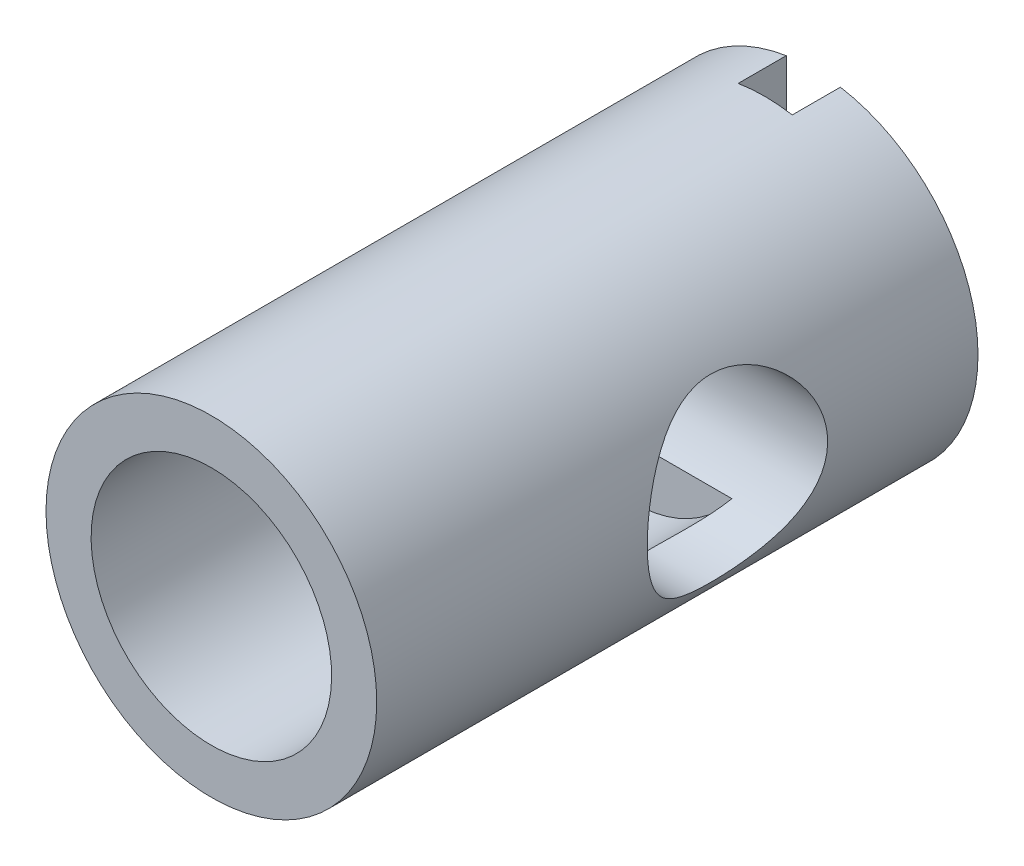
ISO-10303-21;
HEADER;
FILE_DESCRIPTION(('STEP AP214'),'2;1');
FILE_NAME('part.step','',(''),(''),'','','');
FILE_SCHEMA(('AUTOMOTIVE_DESIGN { 1 0 10303 214 1 1 1 1 }'));
ENDSEC;
DATA;
#1=APPLICATION_CONTEXT('core data for automotive mechanical design processes');
#2=APPLICATION_PROTOCOL_DEFINITION('international standard','automotive_design',2000,#1);
#3=PRODUCT_CONTEXT('',#1,'mechanical');
#4=PRODUCT('Part','Part','',(#3));
#5=PRODUCT_RELATED_PRODUCT_CATEGORY('part','',(#4));
#6=PRODUCT_DEFINITION_FORMATION('','',#4);
#7=PRODUCT_DEFINITION_CONTEXT('part definition',#1,'design');
#8=PRODUCT_DEFINITION('design','',#6,#7);
#9=PRODUCT_DEFINITION_SHAPE('','',#8);
#10=(LENGTH_UNIT() NAMED_UNIT(*) SI_UNIT(.MILLI.,.METRE.));
#11=(NAMED_UNIT(*) PLANE_ANGLE_UNIT() SI_UNIT($,.RADIAN.));
#12=(NAMED_UNIT(*) SI_UNIT($,.STERADIAN.) SOLID_ANGLE_UNIT());
#13=UNCERTAINTY_MEASURE_WITH_UNIT(LENGTH_MEASURE(1.E-05),#10,'distance_accuracy_value','');
#14=(GEOMETRIC_REPRESENTATION_CONTEXT(3) GLOBAL_UNCERTAINTY_ASSIGNED_CONTEXT((#13)) GLOBAL_UNIT_ASSIGNED_CONTEXT((#10,
#11,#12)) REPRESENTATION_CONTEXT('',''));
#15=CARTESIAN_POINT('',(0.,0.,0.));
#16=DIRECTION('',(0.,0.,1.));
#17=DIRECTION('',(1.,0.,0.));
#18=AXIS2_PLACEMENT_3D('',#15,#16,#17);
#19=CARTESIAN_POINT('',(0.461597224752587,0.,0.8));
#20=DIRECTION('',(0.,0.,1.));
#21=DIRECTION('',(1.,0.,0.));
#22=AXIS2_PLACEMENT_3D('',#19,#20,#21);
#23=PLANE('',#22);
#24=DIRECTION('',(0.,1.,0.));
#25=VECTOR('',#24,1.);
#26=CARTESIAN_POINT('',(-0.438402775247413,0.,0.8));
#27=LINE('',#26,#25);
#28=CARTESIAN_POINT('',(-0.438402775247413,-2.71483019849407,0.8));
#29=VERTEX_POINT('',#28);
#30=CARTESIAN_POINT('',(-0.438402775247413,2.71483019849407,0.8));
#31=VERTEX_POINT('',#30);
#32=EDGE_CURVE('E83',#29,#31,#27,.T.);
#33=ORIENTED_EDGE('',*,*,#32,.T.);
#34=CARTESIAN_POINT('',(0.,0.,0.8));
#35=DIRECTION('',(0.,0.,1.));
#36=DIRECTION('',(1.,0.,0.));
#37=AXIS2_PLACEMENT_3D('',#34,#35,#36);
#38=CIRCLE('',#37,2.75);
#39=CARTESIAN_POINT('',(0.461597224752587,2.71098284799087,0.8));
#40=VERTEX_POINT('',#39);
#41=EDGE_CURVE('E21',#40,#31,#38,.T.);
#42=ORIENTED_EDGE('',*,*,#41,.F.);
#43=DIRECTION('',(0.,1.,0.));
#44=VECTOR('',#43,1.);
#45=CARTESIAN_POINT('',(0.461597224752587,0.,0.8));
#46=LINE('',#45,#44);
#47=CARTESIAN_POINT('',(0.461597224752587,-2.71098284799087,0.8));
#48=VERTEX_POINT('',#47);
#49=EDGE_CURVE('E76',#40,#48,#46,.F.);
#50=ORIENTED_EDGE('',*,*,#49,.T.);
#51=CARTESIAN_POINT('',(0.,0.,0.8));
#52=DIRECTION('',(0.,0.,1.));
#53=DIRECTION('',(1.,0.,0.));
#54=AXIS2_PLACEMENT_3D('',#51,#52,#53);
#55=CIRCLE('',#54,2.75);
#56=EDGE_CURVE('E84',#29,#48,#55,.T.);
#57=ORIENTED_EDGE('',*,*,#56,.F.);
#58=EDGE_LOOP('',(#33,#42,#50,#57));
#59=FACE_BOUND('',#58,.T.);
#60=ADVANCED_FACE('F16',(#59),#23,.F.);
#61=CARTESIAN_POINT('',(-1.6583123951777,2.0088196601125,3.));
#62=DIRECTION('',(0.,0.,-1.));
#63=DIRECTION('',(1.,0.,0.));
#64=AXIS2_PLACEMENT_3D('',#61,#62,#63);
#65=PLANE('',#64);
#66=CARTESIAN_POINT('',(0.,0.,3.));
#67=DIRECTION('',(0.,0.,-1.));
#68=DIRECTION('',(0.,1.,0.));
#69=AXIS2_PLACEMENT_3D('',#66,#67,#68);
#70=CIRCLE('',#69,2.);
#71=CARTESIAN_POINT('',(1.65831239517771,1.1180339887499,3.));
#72=VERTEX_POINT('',#71);
#73=CARTESIAN_POINT('',(-1.6583123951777,1.1180339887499,3.));
#74=VERTEX_POINT('',#73);
#75=EDGE_CURVE('E152',#72,#74,#70,.F.);
#76=ORIENTED_EDGE('',*,*,#75,.T.);
#77=DIRECTION('',(1.,0.,0.));
#78=VECTOR('',#77,1.);
#79=CARTESIAN_POINT('',(0.,1.11803398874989,3.));
#80=LINE('',#79,#78);
#81=EDGE_CURVE('E136',#74,#72,#80,.T.);
#82=ORIENTED_EDGE('',*,*,#81,.T.);
#83=EDGE_LOOP('',(#76,#82));
#84=FACE_BOUND('',#83,.T.);
#85=ADVANCED_FACE('F155',(#84),#65,.F.);
#86=CARTESIAN_POINT('',(-1.6583123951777,-1.11803398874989,3.));
#87=DIRECTION('',(0.,0.,-1.));
#88=DIRECTION('',(1.,0.,0.));
#89=AXIS2_PLACEMENT_3D('',#86,#87,#88);
#90=PLANE('',#89);
#91=CARTESIAN_POINT('',(0.,0.,3.));
#92=DIRECTION('',(0.,0.,-1.));
#93=DIRECTION('',(0.,1.,0.));
#94=AXIS2_PLACEMENT_3D('',#91,#92,#93);
#95=CIRCLE('',#94,2.);
#96=CARTESIAN_POINT('',(-1.65831239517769,-1.11803398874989,3.));
#97=VERTEX_POINT('',#96);
#98=CARTESIAN_POINT('',(1.6583123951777,-1.11803398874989,3.));
#99=VERTEX_POINT('',#98);
#100=EDGE_CURVE('E77',#97,#99,#95,.F.);
#101=ORIENTED_EDGE('',*,*,#100,.T.);
#102=DIRECTION('',(1.,0.,0.));
#103=VECTOR('',#102,1.);
#104=CARTESIAN_POINT('',(0.,-1.11803398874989,3.));
#105=LINE('',#104,#103);
#106=EDGE_CURVE('E131',#99,#97,#105,.F.);
#107=ORIENTED_EDGE('',*,*,#106,.T.);
#108=EDGE_LOOP('',(#101,#107));
#109=FACE_BOUND('',#108,.T.);
#110=ADVANCED_FACE('F166',(#109),#90,.F.);
#111=CARTESIAN_POINT('',(0.,0.,10.));
#112=DIRECTION('',(0.,0.,-1.));
#113=DIRECTION('',(0.,1.,0.));
#114=AXIS2_PLACEMENT_3D('',#111,#112,#113);
#115=CYLINDRICAL_SURFACE('',#114,2.);
#116=ORIENTED_EDGE('',*,*,#100,.F.);
#117=CARTESIAN_POINT('',(-1.65831239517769,-1.11803398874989,3.));
#118=CARTESIAN_POINT('',(-1.6400012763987,-1.14520243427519,3.03038665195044));
#119=CARTESIAN_POINT('',(-1.62156036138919,-1.17110586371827,3.06182893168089));
#120=CARTESIAN_POINT('',(-1.58483591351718,-1.2203420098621,3.12682430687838));
#121=CARTESIAN_POINT('',(-1.56655260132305,-1.24367153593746,3.16037994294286));
#122=CARTESIAN_POINT('',(-1.53036731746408,-1.28794596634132,3.22998871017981));
#123=CARTESIAN_POINT('',(-1.51247370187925,-1.30885485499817,3.26606921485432));
#124=CARTESIAN_POINT('',(-1.47789034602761,-1.34778265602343,3.34027475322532));
#125=CARTESIAN_POINT('',(-1.46119995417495,-1.36580313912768,3.37839866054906));
#126=CARTESIAN_POINT('',(-1.4221746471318,-1.40660834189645,3.47524275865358));
#127=CARTESIAN_POINT('',(-1.40090414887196,-1.42761465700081,3.53517533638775));
#128=CARTESIAN_POINT('',(-1.36490098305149,-1.4620776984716,3.65879844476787));
#129=CARTESIAN_POINT('',(-1.35013694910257,-1.47557072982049,3.72246923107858));
#130=CARTESIAN_POINT('',(-1.32939675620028,-1.49429450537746,3.85338363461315));
#131=CARTESIAN_POINT('',(-1.32353695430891,-1.49941591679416,3.92066285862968));
#132=CARTESIAN_POINT('',(-1.3223225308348,-1.50048867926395,4.05541196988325));
#133=CARTESIAN_POINT('',(-1.3269691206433,-1.49643897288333,4.12288187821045));
#134=CARTESIAN_POINT('',(-1.34420038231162,-1.48095304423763,4.2448675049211));
#135=CARTESIAN_POINT('',(-1.3554261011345,-1.47077461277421,4.29975559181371));
#136=CARTESIAN_POINT('',(-1.38305583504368,-1.44482424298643,4.40684423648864));
#137=CARTESIAN_POINT('',(-1.39946552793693,-1.4290461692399,4.45904177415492));
#138=CARTESIAN_POINT('',(-1.44662419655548,-1.38164647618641,4.59025697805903));
#139=CARTESIAN_POINT('',(-1.48011596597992,-1.34617237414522,4.66689284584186));
#140=CARTESIAN_POINT('',(-1.55090672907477,-1.26398116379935,4.81199139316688));
#141=CARTESIAN_POINT('',(-1.5882144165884,-1.21723803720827,4.88043460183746));
#142=CARTESIAN_POINT('',(-1.66386796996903,-1.11170243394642,5.01060779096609));
#143=CARTESIAN_POINT('',(-1.70221331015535,-1.05260616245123,5.07209270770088));
#144=CARTESIAN_POINT('',(-1.77546249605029,-0.923696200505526,5.18494717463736));
#145=CARTESIAN_POINT('',(-1.81037197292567,-0.853900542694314,5.23633341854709));
#146=CARTESIAN_POINT('',(-1.86813358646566,-0.717339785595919,5.31933444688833));
#147=CARTESIAN_POINT('',(-1.89202675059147,-0.652166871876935,5.35283425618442));
#148=CARTESIAN_POINT('',(-1.93362191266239,-0.515913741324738,5.41042246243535));
#149=CARTESIAN_POINT('',(-1.95132750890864,-0.444836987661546,5.43451633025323));
#150=CARTESIAN_POINT('',(-1.97910694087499,-0.297918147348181,5.47208219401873));
#151=CARTESIAN_POINT('',(-1.98912872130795,-0.222047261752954,5.48548176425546));
#152=CARTESIAN_POINT('',(-2.00030454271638,-0.0685078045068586,5.50041471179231));
#153=CARTESIAN_POINT('',(-2.00146359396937,0.00915972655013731,5.50195479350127));
#154=CARTESIAN_POINT('',(-1.99518445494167,0.154775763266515,5.49357461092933));
#155=CARTESIAN_POINT('',(-1.98868900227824,0.222843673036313,5.48491110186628));
#156=CARTESIAN_POINT('',(-1.96916967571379,0.356254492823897,5.45866585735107));
#157=CARTESIAN_POINT('',(-1.95614465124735,0.421596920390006,5.441082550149));
#158=CARTESIAN_POINT('',(-1.92418864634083,0.54949306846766,5.39740060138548));
#159=CARTESIAN_POINT('',(-1.90513410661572,0.611953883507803,5.37112323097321));
#160=CARTESIAN_POINT('',(-1.86249552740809,0.731536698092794,5.31123264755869));
#161=CARTESIAN_POINT('',(-1.83891076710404,0.78865784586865,5.2776182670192));
#162=CARTESIAN_POINT('',(-1.78450202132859,0.90573606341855,5.19809181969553));
#163=CARTESIAN_POINT('',(-1.75312361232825,0.964680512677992,5.15107224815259));
#164=CARTESIAN_POINT('',(-1.68813652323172,1.07437042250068,5.0494439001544));
#165=CARTESIAN_POINT('',(-1.65452360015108,1.12509961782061,4.99482045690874));
#166=CARTESIAN_POINT('',(-1.58084031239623,1.22703553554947,4.86734904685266));
#167=CARTESIAN_POINT('',(-1.54078553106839,1.276416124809,4.7930228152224));
#168=CARTESIAN_POINT('',(-1.46567311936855,1.36199370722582,4.63484051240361));
#169=CARTESIAN_POINT('',(-1.4306046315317,1.39821962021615,4.55100588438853));
#170=CARTESIAN_POINT('',(-1.38314185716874,1.44485003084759,4.40719545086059));
#171=CARTESIAN_POINT('',(-1.36716246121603,1.45984805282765,4.34990890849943));
#172=CARTESIAN_POINT('',(-1.3419534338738,1.4830571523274,4.23259346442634));
#173=CARTESIAN_POINT('',(-1.33270803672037,1.49128408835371,4.17257132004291));
#174=CARTESIAN_POINT('',(-1.32245654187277,1.5003878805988,4.05080930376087));
#175=CARTESIAN_POINT('',(-1.32150793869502,1.50121344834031,3.98906041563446));
#176=CARTESIAN_POINT('',(-1.32818926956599,1.49530197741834,3.86638746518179));
#177=CARTESIAN_POINT('',(-1.3358256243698,1.4885592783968,3.80546405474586));
#178=CARTESIAN_POINT('',(-1.36008668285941,1.46644668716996,3.67681696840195));
#179=CARTESIAN_POINT('',(-1.37794170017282,1.44988124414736,3.60954123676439));
#180=CARTESIAN_POINT('',(-1.42022023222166,1.40849062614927,3.47957430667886));
#181=CARTESIAN_POINT('',(-1.44467270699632,1.38362891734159,3.41690490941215));
#182=CARTESIAN_POINT('',(-1.49984097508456,1.32374125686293,3.29073686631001));
#183=CARTESIAN_POINT('',(-1.53093704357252,1.28795321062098,3.2277692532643));
#184=CARTESIAN_POINT('',(-1.57851347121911,1.22838778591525,3.13841679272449));
#185=CARTESIAN_POINT('',(-1.59443943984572,1.20767912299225,3.10962408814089));
#186=CARTESIAN_POINT('',(-1.62637642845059,1.16431268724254,3.05362474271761));
#187=CARTESIAN_POINT('',(-1.64238739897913,1.14165595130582,3.02641727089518));
#188=CARTESIAN_POINT('',(-1.6583123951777,1.11803398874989,3.));
#189=B_SPLINE_CURVE_WITH_KNOTS('',3,(#117,#118,#119,#120,#121,#122,#123,#124,#125,#126,#127,
#128,#129,#130,#131,#132,#133,#134,#135,#136,#137,#138,#139,#140,#141,#142,#143,#144,#145,#146,
#147,#148,#149,#150,#151,#152,#153,#154,#155,#156,#157,#158,#159,#160,#161,#162,#163,#164,#165,
#166,#167,#168,#169,#170,#171,#172,#173,#174,#175,#176,#177,#178,#179,#180,#181,#182,#183,#184,
#185,#186,#187,#188),.UNSPECIFIED.,.F.,.F.,(4,2,2,2,2,2,2,2,2,2,2,2,2,2,2,2,2,2,2,2,2,2,2,2,2,2,
2,2,2,2,2,2,2,2,2,4),(0.,0.134027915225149,0.268220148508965,0.404204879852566,
0.540115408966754,0.740313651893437,0.93953592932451,1.14133983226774,1.34316700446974,
1.51334725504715,1.68371454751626,1.9547732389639,2.22646385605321,2.50585008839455,
2.78477052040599,3.01507530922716,3.24524594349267,3.47696245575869,3.70854796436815,
3.91435182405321,4.12019196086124,4.33055797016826,4.54095747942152,4.78507626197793,
5.0296726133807,5.32184186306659,5.61336484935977,5.79671909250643,5.97964267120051,
6.16383286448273,6.34816090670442,6.56163488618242,6.77606161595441,7.01169631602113,
7.12826468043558,7.24477137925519),.UNSPECIFIED.);
#190=EDGE_CURVE('E125',#97,#74,#189,.T.);
#191=ORIENTED_EDGE('',*,*,#190,.T.);
#192=ORIENTED_EDGE('',*,*,#75,.F.);
#193=CARTESIAN_POINT('',(1.65831239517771,1.1180339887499,3.));
#194=CARTESIAN_POINT('',(1.64000127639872,1.14520243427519,3.03038665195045));
#195=CARTESIAN_POINT('',(1.62156036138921,1.17110586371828,3.0618289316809));
#196=CARTESIAN_POINT('',(1.5848359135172,1.22034200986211,3.12682430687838));
#197=CARTESIAN_POINT('',(1.56655260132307,1.24367153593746,3.16037994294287));
#198=CARTESIAN_POINT('',(1.5303673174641,1.28794596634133,3.22998871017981));
#199=CARTESIAN_POINT('',(1.51247370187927,1.30885485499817,3.26606921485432));
#200=CARTESIAN_POINT('',(1.47789034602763,1.34778265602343,3.34027475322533));
#201=CARTESIAN_POINT('',(1.46119995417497,1.36580313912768,3.37839866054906));
#202=CARTESIAN_POINT('',(1.42217464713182,1.40660834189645,3.47524275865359));
#203=CARTESIAN_POINT('',(1.40090414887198,1.42761465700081,3.53517533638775));
#204=CARTESIAN_POINT('',(1.36490098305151,1.46207769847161,3.65879844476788));
#205=CARTESIAN_POINT('',(1.35013694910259,1.47557072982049,3.72246923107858));
#206=CARTESIAN_POINT('',(1.32939675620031,1.49429450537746,3.85338363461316));
#207=CARTESIAN_POINT('',(1.32353695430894,1.49941591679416,3.92066285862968));
#208=CARTESIAN_POINT('',(1.32232253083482,1.50048867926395,4.05541196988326));
#209=CARTESIAN_POINT('',(1.32696912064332,1.49643897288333,4.12288187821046));
#210=CARTESIAN_POINT('',(1.34420038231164,1.48095304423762,4.24486750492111));
#211=CARTESIAN_POINT('',(1.35542610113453,1.47077461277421,4.29975559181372));
#212=CARTESIAN_POINT('',(1.38305583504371,1.44482424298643,4.40684423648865));
#213=CARTESIAN_POINT('',(1.39946552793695,1.4290461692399,4.45904177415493));
#214=CARTESIAN_POINT('',(1.4466241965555,1.3816464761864,4.59025697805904));
#215=CARTESIAN_POINT('',(1.48011596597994,1.34617237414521,4.66689284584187));
#216=CARTESIAN_POINT('',(1.5509067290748,1.26398116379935,4.81199139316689));
#217=CARTESIAN_POINT('',(1.58821441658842,1.21723803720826,4.88043460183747));
#218=CARTESIAN_POINT('',(1.66386796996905,1.11170243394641,5.0106077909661));
#219=CARTESIAN_POINT('',(1.70221331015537,1.05260616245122,5.07209270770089));
#220=CARTESIAN_POINT('',(1.77546249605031,0.923696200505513,5.18494717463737));
#221=CARTESIAN_POINT('',(1.81037197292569,0.8539005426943,5.2363334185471));
#222=CARTESIAN_POINT('',(1.86813358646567,0.717339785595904,5.31933444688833));
#223=CARTESIAN_POINT('',(1.89202675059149,0.65216687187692,5.35283425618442));
#224=CARTESIAN_POINT('',(1.9336219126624,0.515913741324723,5.41042246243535));
#225=CARTESIAN_POINT('',(1.95132750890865,0.444836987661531,5.43451633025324));
#226=CARTESIAN_POINT('',(1.979106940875,0.297918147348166,5.47208219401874));
#227=CARTESIAN_POINT('',(1.98912872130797,0.222047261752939,5.48548176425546));
#228=CARTESIAN_POINT('',(2.00030454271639,0.0685078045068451,5.50041471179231));
#229=CARTESIAN_POINT('',(2.00146359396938,-0.00915972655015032,5.50195479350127));
#230=CARTESIAN_POINT('',(1.99518445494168,-0.154775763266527,5.49357461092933));
#231=CARTESIAN_POINT('',(1.98868900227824,-0.222843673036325,5.48491110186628));
#232=CARTESIAN_POINT('',(1.96916967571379,-0.356254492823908,5.45866585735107));
#233=CARTESIAN_POINT('',(1.95614465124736,-0.421596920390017,5.441082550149));
#234=CARTESIAN_POINT('',(1.92418864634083,-0.549493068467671,5.39740060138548));
#235=CARTESIAN_POINT('',(1.90513410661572,-0.611953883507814,5.37112323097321));
#236=CARTESIAN_POINT('',(1.86249552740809,-0.731536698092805,5.31123264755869));
#237=CARTESIAN_POINT('',(1.83891076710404,-0.78865784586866,5.2776182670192));
#238=CARTESIAN_POINT('',(1.78450202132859,-0.90573606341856,5.19809181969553));
#239=CARTESIAN_POINT('',(1.75312361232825,-0.964680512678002,5.15107224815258));
#240=CARTESIAN_POINT('',(1.68813652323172,-1.07437042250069,5.04944390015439));
#241=CARTESIAN_POINT('',(1.65452360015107,-1.12509961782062,4.99482045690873));
#242=CARTESIAN_POINT('',(1.58084031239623,-1.22703553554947,4.86734904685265));
#243=CARTESIAN_POINT('',(1.54078553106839,-1.276416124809,4.79302281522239));
#244=CARTESIAN_POINT('',(1.46567311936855,-1.36199370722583,4.63484051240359));
#245=CARTESIAN_POINT('',(1.43060463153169,-1.39821962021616,4.55100588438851));
#246=CARTESIAN_POINT('',(1.38314185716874,-1.44485003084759,4.40719545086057));
#247=CARTESIAN_POINT('',(1.36716246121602,-1.45984805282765,4.34990890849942));
#248=CARTESIAN_POINT('',(1.3419534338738,-1.4830571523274,4.23259346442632));
#249=CARTESIAN_POINT('',(1.33270803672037,-1.49128408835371,4.17257132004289));
#250=CARTESIAN_POINT('',(1.32245654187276,-1.5003878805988,4.05080930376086));
#251=CARTESIAN_POINT('',(1.32150793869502,-1.50121344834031,3.98906041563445));
#252=CARTESIAN_POINT('',(1.32818926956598,-1.49530197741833,3.86638746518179));
#253=CARTESIAN_POINT('',(1.3358256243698,-1.4885592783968,3.80546405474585));
#254=CARTESIAN_POINT('',(1.36008668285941,-1.46644668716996,3.67681696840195));
#255=CARTESIAN_POINT('',(1.37794170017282,-1.44988124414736,3.60954123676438));
#256=CARTESIAN_POINT('',(1.42022023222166,-1.40849062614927,3.47957430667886));
#257=CARTESIAN_POINT('',(1.44467270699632,-1.38362891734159,3.41690490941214));
#258=CARTESIAN_POINT('',(1.49984097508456,-1.32374125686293,3.29073686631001));
#259=CARTESIAN_POINT('',(1.53093704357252,-1.28795321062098,3.22776925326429));
#260=CARTESIAN_POINT('',(1.57851347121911,-1.22838778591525,3.13841679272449));
#261=CARTESIAN_POINT('',(1.59443943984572,-1.20767912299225,3.10962408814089));
#262=CARTESIAN_POINT('',(1.62637642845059,-1.16431268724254,3.05362474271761));
#263=CARTESIAN_POINT('',(1.64238739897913,-1.14165595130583,3.02641727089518));
#264=CARTESIAN_POINT('',(1.6583123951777,-1.1180339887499,3.));
#265=B_SPLINE_CURVE_WITH_KNOTS('',3,(#193,#194,#195,#196,#197,#198,#199,#200,#201,#202,#203,
#204,#205,#206,#207,#208,#209,#210,#211,#212,#213,#214,#215,#216,#217,#218,#219,#220,#221,#222,
#223,#224,#225,#226,#227,#228,#229,#230,#231,#232,#233,#234,#235,#236,#237,#238,#239,#240,#241,
#242,#243,#244,#245,#246,#247,#248,#249,#250,#251,#252,#253,#254,#255,#256,#257,#258,#259,#260,
#261,#262,#263,#264),.UNSPECIFIED.,.F.,.F.,(4,2,2,2,2,2,2,2,2,2,2,2,2,2,2,2,2,2,2,2,2,2,2,2,2,2,
2,2,2,2,2,2,2,2,2,4),(0.,0.134027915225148,0.268220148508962,0.404204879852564,
0.540115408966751,0.740313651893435,0.939535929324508,1.14133983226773,1.34316700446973,
1.51334725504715,1.68371454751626,1.95477323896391,2.22646385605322,2.50585008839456,
2.78477052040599,3.01507530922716,3.24524594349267,3.47696245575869,3.70854796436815,
3.91435182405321,4.12019196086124,4.33055797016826,4.54095747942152,4.78507626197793,
5.0296726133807,5.3218418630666,5.61336484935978,5.79671909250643,5.97964267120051,
6.16383286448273,6.34816090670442,6.56163488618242,6.7760616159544,7.01169631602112,
7.12826468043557,7.24477137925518),.UNSPECIFIED.);
#266=EDGE_CURVE('E135',#72,#99,#265,.T.);
#267=ORIENTED_EDGE('',*,*,#266,.T.);
#268=EDGE_LOOP('',(#116,#191,#192,#267));
#269=FACE_BOUND('',#268,.T.);
#270=CARTESIAN_POINT('',(0.,0.,10.));
#271=DIRECTION('',(0.,0.,-1.));
#272=DIRECTION('',(0.,1.,0.));
#273=AXIS2_PLACEMENT_3D('',#270,#271,#272);
#274=CIRCLE('',#273,2.);
#275=CARTESIAN_POINT('',(0.,2.,10.));
#276=VERTEX_POINT('',#275);
#277=EDGE_CURVE('E138',#276,#276,#274,.F.);
#278=ORIENTED_EDGE('',*,*,#277,.T.);
#279=EDGE_LOOP('',(#278));
#280=FACE_BOUND('',#279,.T.);
#281=ADVANCED_FACE('F18',(#269,#280),#115,.F.);
#282=CARTESIAN_POINT('',(0.461597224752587,0.,0.));
#283=DIRECTION('',(1.,0.,0.));
#284=DIRECTION('',(0.,0.,-1.));
#285=AXIS2_PLACEMENT_3D('',#282,#283,#284);
#286=PLANE('',#285);
#287=ORIENTED_EDGE('',*,*,#49,.F.);
#288=DIRECTION('',(0.,0.,-1.));
#289=VECTOR('',#288,1.);
#290=CARTESIAN_POINT('',(0.461597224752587,2.71098284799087,0.));
#291=LINE('',#290,#289);
#292=CARTESIAN_POINT('',(0.461597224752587,2.71098284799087,0.));
#293=VERTEX_POINT('',#292);
#294=EDGE_CURVE('E66',#293,#40,#291,.F.);
#295=ORIENTED_EDGE('',*,*,#294,.F.);
#296=DIRECTION('',(0.,1.,0.));
#297=VECTOR('',#296,1.);
#298=CARTESIAN_POINT('',(0.461597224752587,0.,0.));
#299=LINE('',#298,#297);
#300=CARTESIAN_POINT('',(0.461597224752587,-2.71098284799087,0.));
#301=VERTEX_POINT('',#300);
#302=EDGE_CURVE('E123',#301,#293,#299,.T.);
#303=ORIENTED_EDGE('',*,*,#302,.F.);
#304=DIRECTION('',(0.,0.,-1.));
#305=VECTOR('',#304,1.);
#306=CARTESIAN_POINT('',(0.461597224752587,-2.71098284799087,0.));
#307=LINE('',#306,#305);
#308=EDGE_CURVE('E86',#48,#301,#307,.T.);
#309=ORIENTED_EDGE('',*,*,#308,.F.);
#310=EDGE_LOOP('',(#287,#295,#303,#309));
#311=FACE_BOUND('',#310,.T.);
#312=ADVANCED_FACE('F85',(#311),#286,.F.);
#313=CARTESIAN_POINT('',(-0.438402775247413,0.,0.8));
#314=DIRECTION('',(-1.,0.,0.));
#315=DIRECTION('',(0.,0.,1.));
#316=AXIS2_PLACEMENT_3D('',#313,#314,#315);
#317=PLANE('',#316);
#318=DIRECTION('',(0.,1.,0.));
#319=VECTOR('',#318,1.);
#320=CARTESIAN_POINT('',(-0.438402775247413,0.,0.));
#321=LINE('',#320,#319);
#322=CARTESIAN_POINT('',(-0.438402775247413,2.71483019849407,0.));
#323=VERTEX_POINT('',#322);
#324=CARTESIAN_POINT('',(-0.438402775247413,-2.71483019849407,0.));
#325=VERTEX_POINT('',#324);
#326=EDGE_CURVE('E124',#323,#325,#321,.F.);
#327=ORIENTED_EDGE('',*,*,#326,.F.);
#328=DIRECTION('',(0.,0.,1.));
#329=VECTOR('',#328,1.);
#330=CARTESIAN_POINT('',(-0.438402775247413,2.71483019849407,0.8));
#331=LINE('',#330,#329);
#332=EDGE_CURVE('E35',#31,#323,#331,.F.);
#333=ORIENTED_EDGE('',*,*,#332,.F.);
#334=ORIENTED_EDGE('',*,*,#32,.F.);
#335=DIRECTION('',(0.,0.,1.));
#336=VECTOR('',#335,1.);
#337=CARTESIAN_POINT('',(-0.438402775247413,-2.71483019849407,0.8));
#338=LINE('',#337,#336);
#339=EDGE_CURVE('E140',#325,#29,#338,.T.);
#340=ORIENTED_EDGE('',*,*,#339,.F.);
#341=EDGE_LOOP('',(#327,#333,#334,#340));
#342=FACE_BOUND('',#341,.T.);
#343=ADVANCED_FACE('F178',(#342),#317,.F.);
#344=CARTESIAN_POINT('',(0.,0.,10.));
#345=DIRECTION('',(0.,0.,-1.));
#346=DIRECTION('',(-1.,0.,0.));
#347=AXIS2_PLACEMENT_3D('',#344,#345,#346);
#348=PLANE('',#347);
#349=ORIENTED_EDGE('',*,*,#277,.F.);
#350=EDGE_LOOP('',(#349));
#351=FACE_BOUND('',#350,.T.);
#352=CARTESIAN_POINT('',(0.,0.,10.));
#353=DIRECTION('',(0.,0.,1.));
#354=DIRECTION('',(1.,0.,0.));
#355=AXIS2_PLACEMENT_3D('',#352,#353,#354);
#356=CIRCLE('',#355,2.75);
#357=CARTESIAN_POINT('',(2.75,0.,10.));
#358=VERTEX_POINT('',#357);
#359=EDGE_CURVE('E128',#358,#358,#356,.F.);
#360=ORIENTED_EDGE('',*,*,#359,.F.);
#361=EDGE_LOOP('',(#360));
#362=FACE_BOUND('',#361,.T.);
#363=ADVANCED_FACE('F121',(#351,#362),#348,.F.);
#364=CARTESIAN_POINT('',(0.,0.,4.));
#365=DIRECTION('',(1.,0.,0.));
#366=DIRECTION('',(0.,0.,-1.));
#367=AXIS2_PLACEMENT_3D('',#364,#365,#366);
#368=CYLINDRICAL_SURFACE('',#367,1.5);
#369=CARTESIAN_POINT('',(-2.30488611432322,1.5,4.));
#370=CARTESIAN_POINT('',(-2.30489421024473,1.49999413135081,4.07699779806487));
#371=CARTESIAN_POINT('',(-2.30880529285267,1.49403027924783,4.15406589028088));
#372=CARTESIAN_POINT('',(-2.32384224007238,1.47052310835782,4.30574199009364));
#373=CARTESIAN_POINT('',(-2.33498052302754,1.45295985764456,4.38034553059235));
#374=CARTESIAN_POINT('',(-2.3627764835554,1.40729873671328,4.52459697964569));
#375=CARTESIAN_POINT('',(-2.37940017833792,1.37926559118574,4.59427227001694));
#376=CARTESIAN_POINT('',(-2.41623891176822,1.31365953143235,4.72790558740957));
#377=CARTESIAN_POINT('',(-2.43645465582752,1.27608474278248,4.79186248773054));
#378=CARTESIAN_POINT('',(-2.48063952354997,1.18809985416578,4.91923299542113));
#379=CARTESIAN_POINT('',(-2.50478202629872,1.13678582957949,4.98196229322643));
#380=CARTESIAN_POINT('',(-2.55270819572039,1.0246471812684,5.09847211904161));
#381=CARTESIAN_POINT('',(-2.57649164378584,0.963817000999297,5.15224738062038));
#382=CARTESIAN_POINT('',(-2.62340283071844,0.828145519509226,5.25376924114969));
#383=CARTESIAN_POINT('',(-2.6463074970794,0.752556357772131,5.30062942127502));
#384=CARTESIAN_POINT('',(-2.68653962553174,0.593081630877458,5.38064983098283));
#385=CARTESIAN_POINT('',(-2.70387126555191,0.509202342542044,5.41382032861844));
#386=CARTESIAN_POINT('',(-2.72973873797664,0.34281529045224,5.46265687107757));
#387=CARTESIAN_POINT('',(-2.73887971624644,0.260759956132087,5.47953610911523));
#388=CARTESIAN_POINT('',(-2.74963355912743,0.0945174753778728,5.49935260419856));
#389=CARTESIAN_POINT('',(-2.75125201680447,0.010331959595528,5.50230021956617));
#390=CARTESIAN_POINT('',(-2.74701957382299,-0.14846327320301,5.49453009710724));
#391=CARTESIAN_POINT('',(-2.74192108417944,-0.223165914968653,5.48518905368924));
#392=CARTESIAN_POINT('',(-2.72602671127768,-0.36974799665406,5.45563618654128));
#393=CARTESIAN_POINT('',(-2.71523039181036,-0.44162721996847,5.43542353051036));
#394=CARTESIAN_POINT('',(-2.6887521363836,-0.581590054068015,5.38468767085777));
#395=CARTESIAN_POINT('',(-2.6730172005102,-0.649622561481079,5.35405229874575));
#396=CARTESIAN_POINT('',(-2.6380078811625,-0.779717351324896,5.28355787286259));
#397=CARTESIAN_POINT('',(-2.61873234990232,-0.841777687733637,5.24369582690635));
#398=CARTESIAN_POINT('',(-2.57594789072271,-0.965247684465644,5.15103183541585));
#399=CARTESIAN_POINT('',(-2.55220670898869,-1.0258813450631,5.09730302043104));
#400=CARTESIAN_POINT('',(-2.5043506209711,-1.13773322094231,4.98086252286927));
#401=CARTESIAN_POINT('',(-2.48023536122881,-1.18894185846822,4.91814181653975));
#402=CARTESIAN_POINT('',(-2.43203284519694,-1.28484880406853,4.77903442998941));
#403=CARTESIAN_POINT('',(-2.40812394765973,-1.32861732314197,4.70193804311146));
#404=CARTESIAN_POINT('',(-2.36600204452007,-1.40226549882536,4.53994724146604));
#405=CARTESIAN_POINT('',(-2.34778248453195,-1.43216115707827,4.45506194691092));
#406=CARTESIAN_POINT('',(-2.3213279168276,-1.47462584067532,4.28699193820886));
#407=CARTESIAN_POINT('',(-2.31240382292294,-1.48840195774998,4.20422619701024));
#408=CARTESIAN_POINT('',(-2.30368170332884,-1.50187468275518,4.03711516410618));
#409=CARTESIAN_POINT('',(-2.30387370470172,-1.50158667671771,3.95277169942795));
#410=CARTESIAN_POINT('',(-2.3126305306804,-1.48804477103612,3.79775047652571));
#411=CARTESIAN_POINT('',(-2.3200042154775,-1.47663524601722,3.72683085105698));
#412=CARTESIAN_POINT('',(-2.34039421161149,-1.4440986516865,3.58810455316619));
#413=CARTESIAN_POINT('',(-2.35341292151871,-1.42296745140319,3.52029921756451));
#414=CARTESIAN_POINT('',(-2.38424525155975,-1.37070327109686,3.38635116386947));
#415=CARTESIAN_POINT('',(-2.40224030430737,-1.3391807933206,3.32040393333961));
#416=CARTESIAN_POINT('',(-2.44089767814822,-1.26735224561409,3.1943400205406));
#417=CARTESIAN_POINT('',(-2.46156132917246,-1.22704178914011,3.13422627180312));
#418=CARTESIAN_POINT('',(-2.50707449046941,-1.13149902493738,3.01174835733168));
#419=CARTESIAN_POINT('',(-2.53207564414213,-1.07492150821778,2.9504849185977));
#420=CARTESIAN_POINT('',(-2.58077925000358,-0.952074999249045,2.83789007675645));
#421=CARTESIAN_POINT('',(-2.60448096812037,-0.885800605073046,2.78656424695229));
#422=CARTESIAN_POINT('',(-2.64932207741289,-0.741333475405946,2.69302898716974));
#423=CARTESIAN_POINT('',(-2.67028379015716,-0.662721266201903,2.65137562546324));
#424=CARTESIAN_POINT('',(-2.70581165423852,-0.49813954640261,2.58232681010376));
#425=CARTESIAN_POINT('',(-2.72038436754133,-0.412177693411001,2.55491672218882));
#426=CARTESIAN_POINT('',(-2.74025647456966,-0.244694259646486,2.51786585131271));
#427=CARTESIAN_POINT('',(-2.74634426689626,-0.163602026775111,2.50670911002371));
#428=CARTESIAN_POINT('',(-2.75120766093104,-0.000479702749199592,2.49778138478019));
#429=CARTESIAN_POINT('',(-2.74998697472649,0.0815498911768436,2.50000360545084));
#430=CARTESIAN_POINT('',(-2.7408062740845,0.236627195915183,2.51690874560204));
#431=CARTESIAN_POINT('',(-2.73344230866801,0.309835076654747,2.53048986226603));
#432=CARTESIAN_POINT('',(-2.71343280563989,0.452760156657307,2.56805386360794));
#433=CARTESIAN_POINT('',(-2.70078662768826,0.522476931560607,2.59203800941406));
#434=CARTESIAN_POINT('',(-2.67075918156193,0.65925983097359,2.65051659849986));
#435=CARTESIAN_POINT('',(-2.65322685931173,0.72614617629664,2.68535139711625));
#436=CARTESIAN_POINT('',(-2.61509254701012,0.853350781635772,2.7641213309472));
#437=CARTESIAN_POINT('',(-2.59448929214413,0.913666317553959,2.80806021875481));
#438=CARTESIAN_POINT('',(-2.54937874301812,1.03329759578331,2.90952811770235));
#439=CARTESIAN_POINT('',(-2.52469397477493,1.09171873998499,2.96803458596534));
#440=CARTESIAN_POINT('',(-2.47586448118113,1.19835006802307,3.09403227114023));
#441=CARTESIAN_POINT('',(-2.45172042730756,1.24654812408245,3.16153400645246));
#442=CARTESIAN_POINT('',(-2.40519083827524,1.33423124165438,3.30888912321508));
#443=CARTESIAN_POINT('',(-2.38301155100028,1.37297721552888,3.38925244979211));
#444=CARTESIAN_POINT('',(-2.34568463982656,1.43583608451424,3.55691256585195));
#445=CARTESIAN_POINT('',(-2.3305144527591,1.45999601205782,3.64418603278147));
#446=CARTESIAN_POINT('',(-2.31521887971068,1.48402805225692,3.77717145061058));
#447=CARTESIAN_POINT('',(-2.3113659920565,1.49000328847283,3.82142792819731));
#448=CARTESIAN_POINT('',(-2.30619725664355,1.49799096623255,3.91044834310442));
#449=CARTESIAN_POINT('',(-2.30488140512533,1.50000341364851,3.95521227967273));
#450=CARTESIAN_POINT('',(-2.30488611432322,1.5,4.));
#451=B_SPLINE_CURVE_WITH_KNOTS('',3,(#369,#370,#371,#372,#373,#374,#375,#376,#377,#378,#379,
#380,#381,#382,#383,#384,#385,#386,#387,#388,#389,#390,#391,#392,#393,#394,#395,#396,#397,#398,
#399,#400,#401,#402,#403,#404,#405,#406,#407,#408,#409,#410,#411,#412,#413,#414,#415,#416,#417,
#418,#419,#420,#421,#422,#423,#424,#425,#426,#427,#428,#429,#430,#431,#432,#433,#434,#435,#436,
#437,#438,#439,#440,#441,#442,#443,#444,#445,#446,#447,#448,#449,#450),.UNSPECIFIED.,.T.,.F.,(4,
2,2,2,2,2,2,2,2,2,2,2,2,2,2,2,2,2,2,2,2,2,2,2,2,2,2,2,2,2,2,2,2,2,2,2,2,2,2,2,4),(0.,
0.230803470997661,0.462004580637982,0.691799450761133,0.921639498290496,1.1742977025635,
1.42710399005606,1.70115561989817,1.97500131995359,2.22637200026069,2.47755575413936,
2.70285922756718,2.92817995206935,3.15600657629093,3.38390718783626,3.63612516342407,
3.88859804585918,4.16263764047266,4.43636035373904,4.68791635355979,4.93919715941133,
5.1548459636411,5.37058648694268,5.59556414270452,5.82065435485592,6.08070639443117,
6.34090385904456,6.6135949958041,6.88600539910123,7.13088300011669,7.37563623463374,
7.5990787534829,7.82254836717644,8.05388690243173,8.28532098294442,8.54308768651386,
8.80115849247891,9.07546804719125,9.34888830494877,9.48314119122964,9.61739387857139),.UNSPECIFIED.);
#452=CARTESIAN_POINT('',(-2.30488611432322,1.5,4.));
#453=VERTEX_POINT('',#452);
#454=EDGE_CURVE('E99',#453,#453,#451,.T.);
#455=ORIENTED_EDGE('',*,*,#454,.F.);
#456=EDGE_LOOP('',(#455));
#457=FACE_BOUND('',#456,.T.);
#458=ORIENTED_EDGE('',*,*,#106,.F.);
#459=ORIENTED_EDGE('',*,*,#266,.F.);
#460=ORIENTED_EDGE('',*,*,#81,.F.);
#461=ORIENTED_EDGE('',*,*,#190,.F.);
#462=EDGE_LOOP('',(#458,#459,#460,#461));
#463=FACE_BOUND('',#462,.T.);
#464=CARTESIAN_POINT('',(2.30488611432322,1.5,4.));
#465=CARTESIAN_POINT('',(2.30489421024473,1.49999413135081,3.92300220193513));
#466=CARTESIAN_POINT('',(2.30880529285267,1.49403027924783,3.84593410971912));
#467=CARTESIAN_POINT('',(2.32384224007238,1.47052310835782,3.69425800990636));
#468=CARTESIAN_POINT('',(2.33498052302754,1.45295985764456,3.61965446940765));
#469=CARTESIAN_POINT('',(2.3627764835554,1.40729873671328,3.47540302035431));
#470=CARTESIAN_POINT('',(2.37940017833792,1.37926559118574,3.40572772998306));
#471=CARTESIAN_POINT('',(2.41623891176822,1.31365953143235,3.27209441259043));
#472=CARTESIAN_POINT('',(2.43645465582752,1.27608474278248,3.20813751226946));
#473=CARTESIAN_POINT('',(2.48063952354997,1.18809985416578,3.08076700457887));
#474=CARTESIAN_POINT('',(2.50478202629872,1.13678582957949,3.01803770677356));
#475=CARTESIAN_POINT('',(2.55270819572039,1.0246471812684,2.90152788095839));
#476=CARTESIAN_POINT('',(2.57649164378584,0.963817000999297,2.84775261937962));
#477=CARTESIAN_POINT('',(2.62340283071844,0.828145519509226,2.74623075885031));
#478=CARTESIAN_POINT('',(2.6463074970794,0.752556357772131,2.69937057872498));
#479=CARTESIAN_POINT('',(2.68653962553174,0.593081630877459,2.61935016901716));
#480=CARTESIAN_POINT('',(2.70387126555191,0.509202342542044,2.58617967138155));
#481=CARTESIAN_POINT('',(2.72973873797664,0.342815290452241,2.53734312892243));
#482=CARTESIAN_POINT('',(2.73887971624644,0.260759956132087,2.52046389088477));
#483=CARTESIAN_POINT('',(2.74963355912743,0.0945174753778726,2.50064739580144));
#484=CARTESIAN_POINT('',(2.75125201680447,0.0103319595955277,2.49769978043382));
#485=CARTESIAN_POINT('',(2.74701957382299,-0.14846327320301,2.50546990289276));
#486=CARTESIAN_POINT('',(2.74192108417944,-0.223165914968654,2.51481094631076));
#487=CARTESIAN_POINT('',(2.72602671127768,-0.369747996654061,2.54436381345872));
#488=CARTESIAN_POINT('',(2.71523039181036,-0.441627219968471,2.56457646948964));
#489=CARTESIAN_POINT('',(2.6887521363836,-0.581590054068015,2.61531232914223));
#490=CARTESIAN_POINT('',(2.6730172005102,-0.649622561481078,2.64594770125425));
#491=CARTESIAN_POINT('',(2.6380078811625,-0.779717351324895,2.71644212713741));
#492=CARTESIAN_POINT('',(2.61873234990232,-0.841777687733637,2.75630417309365));
#493=CARTESIAN_POINT('',(2.57594789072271,-0.965247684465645,2.84896816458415));
#494=CARTESIAN_POINT('',(2.55220670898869,-1.0258813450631,2.90269697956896));
#495=CARTESIAN_POINT('',(2.5043506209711,-1.13773322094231,3.01913747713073));
#496=CARTESIAN_POINT('',(2.48023536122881,-1.18894185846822,3.08185818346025));
#497=CARTESIAN_POINT('',(2.43203284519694,-1.28484880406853,3.22096557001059));
#498=CARTESIAN_POINT('',(2.40812394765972,-1.32861732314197,3.29806195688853));
#499=CARTESIAN_POINT('',(2.36600204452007,-1.40226549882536,3.46005275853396));
#500=CARTESIAN_POINT('',(2.34778248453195,-1.43216115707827,3.54493805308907));
#501=CARTESIAN_POINT('',(2.3213279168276,-1.47462584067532,3.71300806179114));
#502=CARTESIAN_POINT('',(2.31240382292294,-1.48840195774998,3.79577380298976));
#503=CARTESIAN_POINT('',(2.30368170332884,-1.50187468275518,3.96288483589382));
#504=CARTESIAN_POINT('',(2.30387370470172,-1.50158667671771,4.04722830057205));
#505=CARTESIAN_POINT('',(2.3126305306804,-1.48804477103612,4.20224952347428));
#506=CARTESIAN_POINT('',(2.3200042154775,-1.47663524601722,4.27316914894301));
#507=CARTESIAN_POINT('',(2.34039421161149,-1.4440986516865,4.4118954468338));
#508=CARTESIAN_POINT('',(2.35341292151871,-1.42296745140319,4.47970078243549));
#509=CARTESIAN_POINT('',(2.38424525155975,-1.37070327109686,4.61364883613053));
#510=CARTESIAN_POINT('',(2.40224030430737,-1.3391807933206,4.67959606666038));
#511=CARTESIAN_POINT('',(2.44089767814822,-1.26735224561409,4.8056599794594));
#512=CARTESIAN_POINT('',(2.46156132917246,-1.22704178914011,4.86577372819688));
#513=CARTESIAN_POINT('',(2.50707449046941,-1.13149902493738,4.98825164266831));
#514=CARTESIAN_POINT('',(2.53207564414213,-1.07492150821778,5.0495150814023));
#515=CARTESIAN_POINT('',(2.58077925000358,-0.952074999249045,5.16210992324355));
#516=CARTESIAN_POINT('',(2.60448096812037,-0.885800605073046,5.2134357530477));
#517=CARTESIAN_POINT('',(2.64932207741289,-0.741333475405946,5.30697101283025));
#518=CARTESIAN_POINT('',(2.67028379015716,-0.662721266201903,5.34862437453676));
#519=CARTESIAN_POINT('',(2.70581165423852,-0.498139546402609,5.41767318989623));
#520=CARTESIAN_POINT('',(2.72038436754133,-0.412177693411,5.44508327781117));
#521=CARTESIAN_POINT('',(2.74025647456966,-0.244694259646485,5.48213414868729));
#522=CARTESIAN_POINT('',(2.74634426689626,-0.16360202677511,5.49329088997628));
#523=CARTESIAN_POINT('',(2.75120766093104,-0.000479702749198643,5.50221861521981));
#524=CARTESIAN_POINT('',(2.74998697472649,0.0815498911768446,5.49999639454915));
#525=CARTESIAN_POINT('',(2.7408062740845,0.236627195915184,5.48309125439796));
#526=CARTESIAN_POINT('',(2.73344230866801,0.309835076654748,5.46951013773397));
#527=CARTESIAN_POINT('',(2.71343280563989,0.452760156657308,5.43194613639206));
#528=CARTESIAN_POINT('',(2.70078662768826,0.522476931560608,5.40796199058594));
#529=CARTESIAN_POINT('',(2.67075918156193,0.659259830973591,5.34948340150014));
#530=CARTESIAN_POINT('',(2.65322685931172,0.726146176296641,5.31464860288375));
#531=CARTESIAN_POINT('',(2.61509254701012,0.853350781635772,5.2358786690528));
#532=CARTESIAN_POINT('',(2.59448929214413,0.91366631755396,5.19193978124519));
#533=CARTESIAN_POINT('',(2.54937874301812,1.03329759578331,5.09047188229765));
#534=CARTESIAN_POINT('',(2.52469397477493,1.09171873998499,5.03196541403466));
#535=CARTESIAN_POINT('',(2.47586448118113,1.19835006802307,4.90596772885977));
#536=CARTESIAN_POINT('',(2.45172042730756,1.24654812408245,4.83846599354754));
#537=CARTESIAN_POINT('',(2.40519083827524,1.33423124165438,4.69111087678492));
#538=CARTESIAN_POINT('',(2.38301155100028,1.37297721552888,4.61074755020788));
#539=CARTESIAN_POINT('',(2.34568463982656,1.43583608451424,4.44308743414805));
#540=CARTESIAN_POINT('',(2.3305144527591,1.45999601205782,4.35581396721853));
#541=CARTESIAN_POINT('',(2.31521887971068,1.48402805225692,4.22282854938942));
#542=CARTESIAN_POINT('',(2.3113659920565,1.49000328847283,4.17857207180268));
#543=CARTESIAN_POINT('',(2.30619725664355,1.49799096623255,4.08955165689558));
#544=CARTESIAN_POINT('',(2.30488140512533,1.50000341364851,4.04478772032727));
#545=CARTESIAN_POINT('',(2.30488611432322,1.5,4.));
#546=B_SPLINE_CURVE_WITH_KNOTS('',3,(#464,#465,#466,#467,#468,#469,#470,#471,#472,#473,#474,
#475,#476,#477,#478,#479,#480,#481,#482,#483,#484,#485,#486,#487,#488,#489,#490,#491,#492,#493,
#494,#495,#496,#497,#498,#499,#500,#501,#502,#503,#504,#505,#506,#507,#508,#509,#510,#511,#512,
#513,#514,#515,#516,#517,#518,#519,#520,#521,#522,#523,#524,#525,#526,#527,#528,#529,#530,#531,
#532,#533,#534,#535,#536,#537,#538,#539,#540,#541,#542,#543,#544,#545),.UNSPECIFIED.,.T.,.F.,(4,
2,2,2,2,2,2,2,2,2,2,2,2,2,2,2,2,2,2,2,2,2,2,2,2,2,2,2,2,2,2,2,2,2,2,2,2,2,2,2,4),(0.,
0.23080347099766,0.462004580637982,0.691799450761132,0.921639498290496,1.17429770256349,
1.42710399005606,1.70115561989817,1.97500131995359,2.22637200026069,2.47755575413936,
2.70285922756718,2.92817995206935,3.15600657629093,3.38390718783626,3.63612516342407,
3.88859804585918,4.16263764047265,4.43636035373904,4.68791635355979,4.93919715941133,
5.1548459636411,5.37058648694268,5.59556414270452,5.82065435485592,6.08070639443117,
6.34090385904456,6.6135949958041,6.88600539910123,7.13088300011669,7.37563623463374,
7.5990787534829,7.82254836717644,8.05388690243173,8.28532098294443,8.54308768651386,
8.80115849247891,9.07546804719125,9.34888830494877,9.48314119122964,9.6173938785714),.UNSPECIFIED.);
#547=CARTESIAN_POINT('',(2.30488611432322,1.5,4.));
#548=VERTEX_POINT('',#547);
#549=EDGE_CURVE('E92',#548,#548,#546,.T.);
#550=ORIENTED_EDGE('',*,*,#549,.F.);
#551=EDGE_LOOP('',(#550));
#552=FACE_BOUND('',#551,.T.);
#553=ADVANCED_FACE('F103',(#457,#463,#552),#368,.F.);
#554=CARTESIAN_POINT('',(0.,0.,0.));
#555=DIRECTION('',(0.,0.,-1.));
#556=DIRECTION('',(-1.,0.,0.));
#557=AXIS2_PLACEMENT_3D('',#554,#555,#556);
#558=PLANE('',#557);
#559=ORIENTED_EDGE('',*,*,#302,.T.);
#560=CARTESIAN_POINT('',(0.,0.,0.));
#561=DIRECTION('',(0.,0.,1.));
#562=DIRECTION('',(1.,0.,0.));
#563=AXIS2_PLACEMENT_3D('',#560,#561,#562);
#564=CIRCLE('',#563,2.75);
#565=EDGE_CURVE('E27',#301,#293,#564,.T.);
#566=ORIENTED_EDGE('',*,*,#565,.F.);
#567=EDGE_LOOP('',(#559,#566));
#568=FACE_BOUND('',#567,.T.);
#569=ADVANCED_FACE('F113',(#568),#558,.T.);
#570=CARTESIAN_POINT('',(0.,0.,0.));
#571=DIRECTION('',(0.,0.,-1.));
#572=DIRECTION('',(-1.,0.,0.));
#573=AXIS2_PLACEMENT_3D('',#570,#571,#572);
#574=PLANE('',#573);
#575=ORIENTED_EDGE('',*,*,#326,.T.);
#576=CARTESIAN_POINT('',(0.,0.,0.));
#577=DIRECTION('',(0.,0.,1.));
#578=DIRECTION('',(1.,0.,0.));
#579=AXIS2_PLACEMENT_3D('',#576,#577,#578);
#580=CIRCLE('',#579,2.75);
#581=EDGE_CURVE('E11',#323,#325,#580,.T.);
#582=ORIENTED_EDGE('',*,*,#581,.F.);
#583=EDGE_LOOP('',(#575,#582));
#584=FACE_BOUND('',#583,.T.);
#585=ADVANCED_FACE('F110',(#584),#574,.T.);
#586=CARTESIAN_POINT('',(0.,0.,0.));
#587=DIRECTION('',(0.,0.,1.));
#588=DIRECTION('',(1.,0.,0.));
#589=AXIS2_PLACEMENT_3D('',#586,#587,#588);
#590=CYLINDRICAL_SURFACE('',#589,2.75);
#591=ORIENTED_EDGE('',*,*,#332,.T.);
#592=ORIENTED_EDGE('',*,*,#581,.T.);
#593=ORIENTED_EDGE('',*,*,#339,.T.);
#594=ORIENTED_EDGE('',*,*,#56,.T.);
#595=ORIENTED_EDGE('',*,*,#308,.T.);
#596=ORIENTED_EDGE('',*,*,#565,.T.);
#597=ORIENTED_EDGE('',*,*,#294,.T.);
#598=ORIENTED_EDGE('',*,*,#41,.T.);
#599=EDGE_LOOP('',(#591,#592,#593,#594,#595,#596,#597,#598));
#600=FACE_BOUND('',#599,.T.);
#601=ORIENTED_EDGE('',*,*,#549,.T.);
#602=EDGE_LOOP('',(#601));
#603=FACE_BOUND('',#602,.T.);
#604=ORIENTED_EDGE('',*,*,#454,.T.);
#605=EDGE_LOOP('',(#604));
#606=FACE_BOUND('',#605,.T.);
#607=ORIENTED_EDGE('',*,*,#359,.T.);
#608=EDGE_LOOP('',(#607));
#609=FACE_BOUND('',#608,.T.);
#610=ADVANCED_FACE('F68',(#600,#603,#606,#609),#590,.T.);
#611=CLOSED_SHELL('',(#60,#85,#110,#281,#312,#343,#363,#553,#569,#585,#610));
#612=MANIFOLD_SOLID_BREP('B1',#611);
#613=ADVANCED_BREP_SHAPE_REPRESENTATION('',(#18,#612),#14);
#614=SHAPE_DEFINITION_REPRESENTATION(#9,#613);
ENDSEC;
END-ISO-10303-21;
